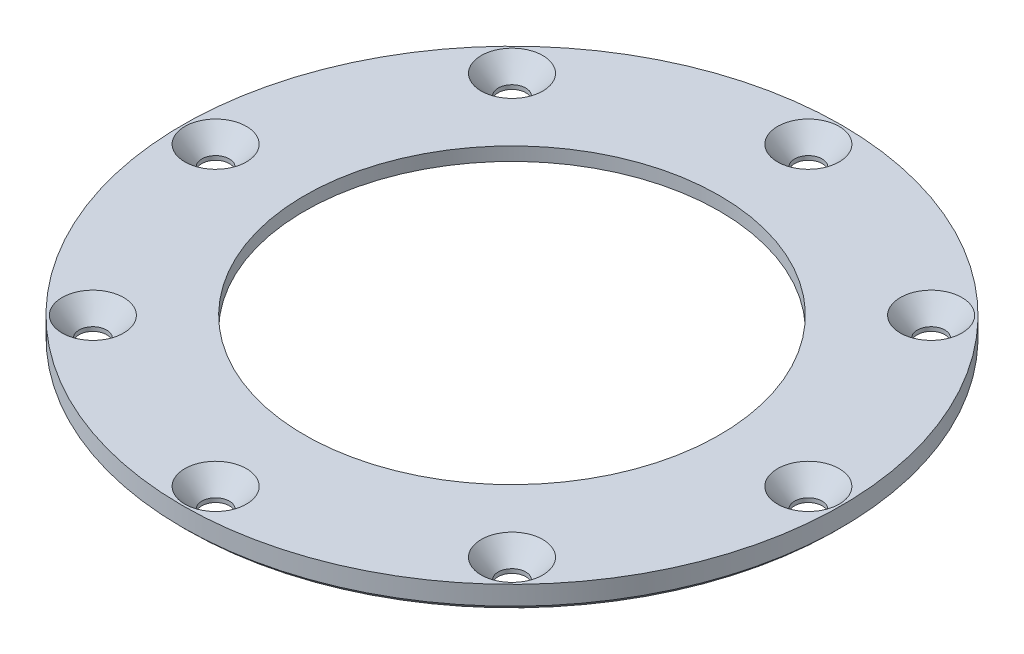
from build123d import *

# Parameters (mm, degrees)
CIRPATTERN1_COUNT = 8
CHAMFER1_SIZE     = 0.508


with BuildPart() as part:
    # Sketch1 → Revolve1 (revolve)
    with BuildSketch(Plane.XY, mode=Mode.PRIVATE) as revolve1_sk:
        Polygon((-24.13, 0), (-35.306, 0), (-35.306, 2.54), (-22.225, 2.54), (-22.225, 1.099852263), align=None)
    revolve(revolve1_sk.sketch.rotate(Axis((0, 0, 0), (0, 1, 0)), 270), axis=Axis((0, 0, 0), (0, 1, 0)))

    # Sketch2 → CSK for _4 Flat Head Machine Screw1 (revolve, cut)
    with BuildSketch(Plane(origin=(-31.75, 2.54, 0), x_dir=(0, 0, 1), z_dir=(1, 0, 0))):
        Polygon((0, 0), (0, 3.884927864), (1.4732, 2.99974), (1.4732, 2.100477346), (3.2991171, 0), align=None)
    csk_for_4_flat_head_machine_screw1 = revolve(axis=Axis((-31.75, 8.89, 0), (0, -1, 0)), mode=Mode.SUBTRACT)

    # CirPattern1: CSK for _4 Flat Head Machine Screw1 ×8 about axis
    cirpattern1_axis = Axis((0, 0, 0), (0, 1, 0))
    for i in range(1, CIRPATTERN1_COUNT):
        add(csk_for_4_flat_head_machine_screw1.rotate(cirpattern1_axis, i * 360 / CIRPATTERN1_COUNT), mode=Mode.SUBTRACT)

    # Chamfer1
    chamfer1_edges = [part.edges().sort_by_distance(p)[0] for p in [
        (0, 0, 35.306),
    ]]
    chamfer(chamfer1_edges, length=CHAMFER1_SIZE)


solid = part.part
